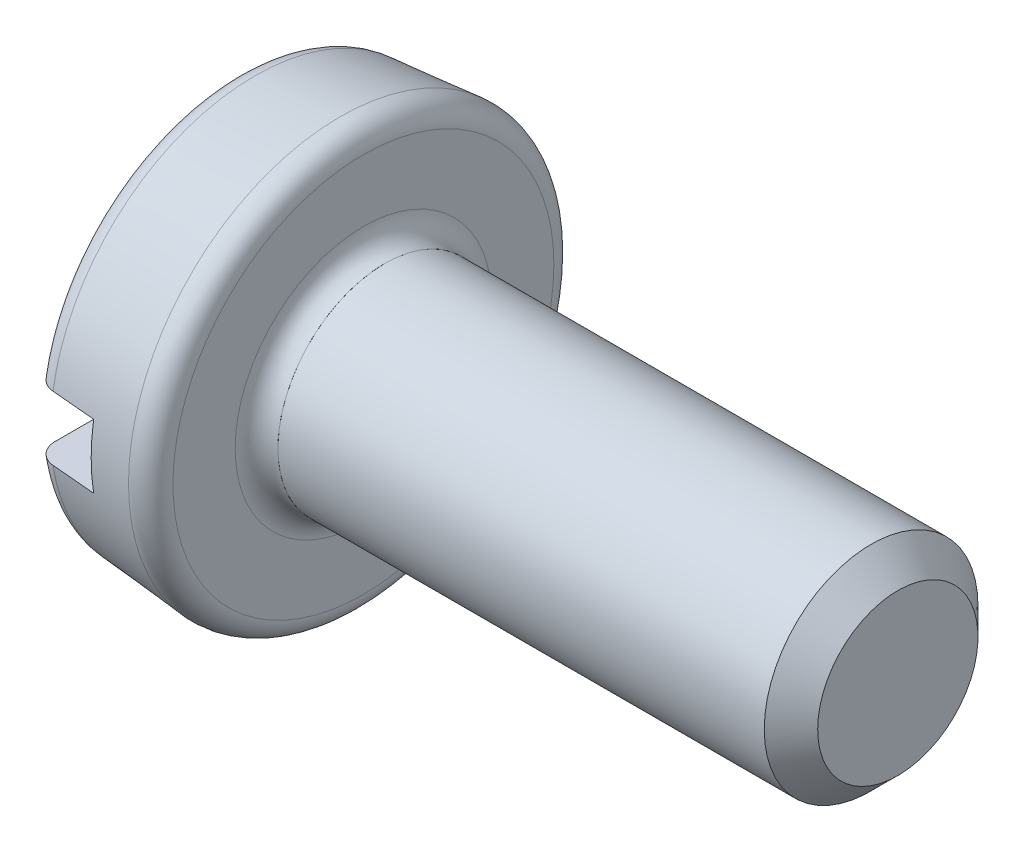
ISO-10303-21;
HEADER;
FILE_DESCRIPTION(('STEP AP214'),'2;1');
FILE_NAME('part.step','',(''),(''),'','','');
FILE_SCHEMA(('AUTOMOTIVE_DESIGN { 1 0 10303 214 1 1 1 1 }'));
ENDSEC;
DATA;
#1=APPLICATION_CONTEXT('core data for automotive mechanical design processes');
#2=APPLICATION_PROTOCOL_DEFINITION('international standard','automotive_design',2000,#1);
#3=PRODUCT_CONTEXT('',#1,'mechanical');
#4=PRODUCT('Part','Part','',(#3));
#5=PRODUCT_RELATED_PRODUCT_CATEGORY('part','',(#4));
#6=PRODUCT_DEFINITION_FORMATION('','',#4);
#7=PRODUCT_DEFINITION_CONTEXT('part definition',#1,'design');
#8=PRODUCT_DEFINITION('design','',#6,#7);
#9=PRODUCT_DEFINITION_SHAPE('','',#8);
#10=(LENGTH_UNIT() NAMED_UNIT(*) SI_UNIT(.MILLI.,.METRE.));
#11=(NAMED_UNIT(*) PLANE_ANGLE_UNIT() SI_UNIT($,.RADIAN.));
#12=(NAMED_UNIT(*) SI_UNIT($,.STERADIAN.) SOLID_ANGLE_UNIT());
#13=UNCERTAINTY_MEASURE_WITH_UNIT(LENGTH_MEASURE(1.E-05),#10,'distance_accuracy_value','');
#14=(GEOMETRIC_REPRESENTATION_CONTEXT(3) GLOBAL_UNCERTAINTY_ASSIGNED_CONTEXT((#13)) GLOBAL_UNIT_ASSIGNED_CONTEXT((#10,
#11,#12)) REPRESENTATION_CONTEXT('',''));
#15=CARTESIAN_POINT('',(0.,0.,0.));
#16=DIRECTION('',(0.,0.,1.));
#17=DIRECTION('',(1.,0.,0.));
#18=AXIS2_PLACEMENT_3D('',#15,#16,#17);
#19=CARTESIAN_POINT('',(-0.6,-0.3,2.378085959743));
#20=DIRECTION('',(1.,0.,0.));
#21=DIRECTION('',(0.,0.,-1.));
#22=AXIS2_PLACEMENT_3D('',#19,#20,#21);
#23=PLANE('',#22);
#24=CARTESIAN_POINT('',(-0.600000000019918,0.,0.));
#25=DIRECTION('',(1.,0.,0.));
#26=DIRECTION('',(0.,0.,-1.));
#27=AXIS2_PLACEMENT_3D('',#24,#25,#26);
#28=CIRCLE('',#27,1.94750680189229);
#29=CARTESIAN_POINT('',(-0.600000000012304,-0.3,-1.92426160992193));
#30=VERTEX_POINT('',#29);
#31=CARTESIAN_POINT('',(-0.600000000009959,0.3,-1.92426160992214));
#32=VERTEX_POINT('',#31);
#33=EDGE_CURVE('P0_E93',#30,#32,#28,.T.);
#34=ORIENTED_EDGE('',*,*,#33,.F.);
#35=DIRECTION('',(0.,0.,-1.));
#36=VECTOR('',#35,1.);
#37=CARTESIAN_POINT('',(-0.6,-0.3,2.378085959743));
#38=LINE('',#37,#36);
#39=CARTESIAN_POINT('',(-0.600000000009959,-0.3,1.92426160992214));
#40=VERTEX_POINT('',#39);
#41=EDGE_CURVE('P0_E100',#30,#40,#38,.F.);
#42=ORIENTED_EDGE('',*,*,#41,.T.);
#43=CARTESIAN_POINT('',(-0.600000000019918,0.,0.));
#44=DIRECTION('',(1.,0.,0.));
#45=DIRECTION('',(0.,0.,-1.));
#46=AXIS2_PLACEMENT_3D('',#43,#44,#45);
#47=CIRCLE('',#46,1.94750680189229);
#48=CARTESIAN_POINT('',(-0.600000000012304,0.3,1.92426160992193));
#49=VERTEX_POINT('',#48);
#50=EDGE_CURVE('P0_E85',#49,#40,#47,.T.);
#51=ORIENTED_EDGE('',*,*,#50,.F.);
#52=DIRECTION('',(0.,0.,1.));
#53=VECTOR('',#52,1.);
#54=CARTESIAN_POINT('',(-0.6,0.3,2.378085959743));
#55=LINE('',#54,#53);
#56=EDGE_CURVE('P0_E92',#49,#32,#55,.F.);
#57=ORIENTED_EDGE('',*,*,#56,.T.);
#58=EDGE_LOOP('',(#34,#42,#51,#57));
#59=FACE_BOUND('',#58,.T.);
#60=ADVANCED_FACE('P0_F16',(#59),#23,.F.);
#61=CARTESIAN_POINT('',(-0.6,0.3,2.378085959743));
#62=DIRECTION('',(0.,1.,0.));
#63=DIRECTION('',(0.,0.,1.));
#64=AXIS2_PLACEMENT_3D('',#61,#62,#63);
#65=PLANE('',#64);
#66=DIRECTION('',(0.,0.,-1.));
#67=VECTOR('',#66,1.);
#68=CARTESIAN_POINT('',(-1.2,0.3,0.));
#69=LINE('',#68,#67);
#70=CARTESIAN_POINT('',(-1.2,0.3,1.685253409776));
#71=VERTEX_POINT('',#70);
#72=CARTESIAN_POINT('',(-1.2,0.3,-1.685253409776));
#73=VERTEX_POINT('',#72);
#74=EDGE_CURVE('P0_E207',#71,#73,#69,.T.);
#75=ORIENTED_EDGE('',*,*,#74,.T.);
#76=CARTESIAN_POINT('',(-1.01743114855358,0.3,-1.88729135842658));
#77=CARTESIAN_POINT('',(-1.02855492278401,0.3,-1.88631602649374));
#78=CARTESIAN_POINT('',(-1.03958952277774,0.3,-1.88437868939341));
#79=CARTESIAN_POINT('',(-1.0611663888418,0.3,-1.87868526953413));
#80=CARTESIAN_POINT('',(-1.07170919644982,0.3,-1.87493124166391));
#81=CARTESIAN_POINT('',(-1.09201834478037,0.3,-1.86570550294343));
#82=CARTESIAN_POINT('',(-1.10178442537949,0.3,-1.86023321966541));
#83=CARTESIAN_POINT('',(-1.12026547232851,0.3,-1.84773796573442));
#84=CARTESIAN_POINT('',(-1.12898056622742,0.3,-1.84071518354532));
#85=CARTESIAN_POINT('',(-1.145176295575,0.3,-1.82527371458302));
#86=CARTESIAN_POINT('',(-1.15264883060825,0.299999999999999,-1.81684653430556));
#87=CARTESIAN_POINT('',(-1.1660944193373,0.3,-1.79887020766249));
#88=CARTESIAN_POINT('',(-1.17206729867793,0.300000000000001,-1.78932093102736));
#89=CARTESIAN_POINT('',(-1.18242806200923,0.300000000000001,-1.76923783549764));
#90=CARTESIAN_POINT('',(-1.18679394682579,0.3,-1.75869266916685));
#91=CARTESIAN_POINT('',(-1.19371148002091,0.3,-1.73703601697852));
#92=CARTESIAN_POINT('',(-1.19626509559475,0.3,-1.72592515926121));
#93=CARTESIAN_POINT('',(-1.19929666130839,0.300000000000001,-1.70493797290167));
#94=CARTESIAN_POINT('',(-1.20000597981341,0.3,-1.69509457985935));
#95=CARTESIAN_POINT('',(-1.2,0.299999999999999,-1.685253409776));
#96=B_SPLINE_CURVE_WITH_KNOTS('',3,(#76,#77,#78,#79,#80,#81,#82,#83,#84,#85,#86,#87,#88,#89,#90,
#91,#92,#93,#94,#95),.UNSPECIFIED.,.F.,.F.,(4,2,2,2,2,2,2,2,2,4),(0.,0.033452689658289,
0.0668676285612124,0.10029371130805,0.133715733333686,0.167347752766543,0.20098368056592,
0.235064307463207,0.269107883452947,0.2986120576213),.UNSPECIFIED.);
#97=CARTESIAN_POINT('',(-1.01743114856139,0.3,-1.88729135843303));
#98=VERTEX_POINT('',#97);
#99=EDGE_CURVE('P0_E108',#98,#73,#96,.T.);
#100=ORIENTED_EDGE('',*,*,#99,.F.);
#101=CARTESIAN_POINT('',(-0.600000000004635,0.3,-1.92426160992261));
#102=CARTESIAN_POINT('',(-0.669571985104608,0.3,-1.91810133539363));
#103=CARTESIAN_POINT('',(-0.739143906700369,0.3,-1.91194034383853));
#104=CARTESIAN_POINT('',(-0.878287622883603,0.3,-1.89961692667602));
#105=CARTESIAN_POINT('',(-0.947859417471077,0.3,-1.89345450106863));
#106=CARTESIAN_POINT('',(-1.01743114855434,0.3,-1.8872913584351));
#107=B_SPLINE_CURVE_WITH_KNOTS('',3,(#101,#102,#103,#104,#105,#106),.UNSPECIFIED.,.F.,.F.,(4,2,
4),(0.,0.209532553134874,0.419065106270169),.UNSPECIFIED.);
#108=EDGE_CURVE('P0_E106',#32,#98,#107,.T.);
#109=ORIENTED_EDGE('',*,*,#108,.F.);
#110=ORIENTED_EDGE('',*,*,#56,.F.);
#111=CARTESIAN_POINT('',(-1.01743114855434,0.3,1.8872913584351));
#112=CARTESIAN_POINT('',(-0.947859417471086,0.3,1.89345450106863));
#113=CARTESIAN_POINT('',(-0.878287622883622,0.3,1.89961692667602));
#114=CARTESIAN_POINT('',(-0.739143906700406,0.3,1.91194034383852));
#115=CARTESIAN_POINT('',(-0.669571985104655,0.3,1.91810133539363));
#116=CARTESIAN_POINT('',(-0.600000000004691,0.3,1.9242616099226));
#117=B_SPLINE_CURVE_WITH_KNOTS('',3,(#111,#112,#113,#114,#115,#116),.UNSPECIFIED.,.F.,.F.,(4,2,
4),(0.,0.209532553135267,0.419065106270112),.UNSPECIFIED.);
#118=CARTESIAN_POINT('',(-1.01743114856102,0.299999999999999,1.88729135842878));
#119=VERTEX_POINT('',#118);
#120=EDGE_CURVE('P0_E80',#119,#49,#117,.T.);
#121=ORIENTED_EDGE('',*,*,#120,.F.);
#122=CARTESIAN_POINT('',(-1.2,0.3,1.685253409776));
#123=CARTESIAN_POINT('',(-1.2000091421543,0.300000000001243,1.69678780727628));
#124=CARTESIAN_POINT('',(-1.19903333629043,0.300000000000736,1.70832090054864));
#125=CARTESIAN_POINT('',(-1.19517364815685,0.299999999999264,1.73106067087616));
#126=CARTESIAN_POINT('',(-1.19229021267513,0.299999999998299,1.74226742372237));
#127=CARTESIAN_POINT('',(-1.18467433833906,0.299999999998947,1.76404410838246));
#128=CARTESIAN_POINT('',(-1.17994059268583,0.300000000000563,1.77461358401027));
#129=CARTESIAN_POINT('',(-1.16875350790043,0.299999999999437,1.7947947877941));
#130=CARTESIAN_POINT('',(-1.16230085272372,0.299999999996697,1.80440689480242));
#131=CARTESIAN_POINT('',(-1.1479094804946,0.299999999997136,1.82231766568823));
#132=CARTESIAN_POINT('',(-1.13998323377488,0.300000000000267,1.83062634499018));
#133=CARTESIAN_POINT('',(-1.12283174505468,0.299999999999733,1.84577236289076));
#134=CARTESIAN_POINT('',(-1.11360664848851,0.299999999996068,1.85260986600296));
#135=CARTESIAN_POINT('',(-1.09424572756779,0.299999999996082,1.86452825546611));
#136=CARTESIAN_POINT('',(-1.08412291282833,0.299999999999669,1.86963028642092));
#137=CARTESIAN_POINT('',(-1.06317023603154,0.30000000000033,1.87803183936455));
#138=CARTESIAN_POINT('',(-1.05234148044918,0.299999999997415,1.88133410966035));
#139=CARTESIAN_POINT('',(-1.03343494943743,0.29999999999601,1.88538028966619));
#140=CARTESIAN_POINT('',(-1.02545352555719,0.299999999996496,1.8865852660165));
#141=CARTESIAN_POINT('',(-1.01743114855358,0.300000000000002,1.88729135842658));
#142=B_SPLINE_CURVE_WITH_KNOTS('',3,(#122,#123,#124,#125,#126,#127,#128,#129,#130,#131,#132,
#133,#134,#135,#136,#137,#138,#139,#140,#141),.UNSPECIFIED.,.F.,.F.,(4,2,2,2,2,2,2,2,2,4),(0.,
0.0345603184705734,0.0691125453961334,0.103689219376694,0.138252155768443,0.17253491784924,
0.206813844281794,0.240658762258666,0.274451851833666,0.298605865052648),.UNSPECIFIED.);
#143=EDGE_CURVE('P0_E336',#71,#119,#142,.T.);
#144=ORIENTED_EDGE('',*,*,#143,.F.);
#145=EDGE_LOOP('',(#75,#100,#109,#110,#121,#144));
#146=FACE_BOUND('',#145,.T.);
#147=ADVANCED_FACE('P0_F104',(#146),#65,.F.);
#148=CARTESIAN_POINT('',(-1.2,-0.3,2.378085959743));
#149=DIRECTION('',(0.,-1.,0.));
#150=DIRECTION('',(0.,0.,-1.));
#151=AXIS2_PLACEMENT_3D('',#148,#149,#150);
#152=PLANE('',#151);
#153=CARTESIAN_POINT('',(-1.01743114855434,-0.3,-1.8872913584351));
#154=CARTESIAN_POINT('',(-0.947859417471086,-0.3,-1.89345450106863));
#155=CARTESIAN_POINT('',(-0.878287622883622,-0.3,-1.89961692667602));
#156=CARTESIAN_POINT('',(-0.739143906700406,-0.3,-1.91194034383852));
#157=CARTESIAN_POINT('',(-0.669571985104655,-0.3,-1.91810133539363));
#158=CARTESIAN_POINT('',(-0.600000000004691,-0.3,-1.9242616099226));
#159=B_SPLINE_CURVE_WITH_KNOTS('',3,(#153,#154,#155,#156,#157,#158),.UNSPECIFIED.,.F.,.F.,(4,2,
4),(0.,0.209532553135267,0.419065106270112),.UNSPECIFIED.);
#160=CARTESIAN_POINT('',(-1.01743114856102,-0.3,-1.88729135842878));
#161=VERTEX_POINT('',#160);
#162=EDGE_CURVE('P0_E117',#161,#30,#159,.T.);
#163=ORIENTED_EDGE('',*,*,#162,.F.);
#164=CARTESIAN_POINT('',(-1.2,-0.3,-1.685253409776));
#165=CARTESIAN_POINT('',(-1.2000091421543,-0.300000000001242,-1.69678780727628));
#166=CARTESIAN_POINT('',(-1.19903333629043,-0.300000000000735,-1.70832090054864));
#167=CARTESIAN_POINT('',(-1.19517364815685,-0.299999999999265,-1.73106067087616));
#168=CARTESIAN_POINT('',(-1.19229021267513,-0.2999999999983,-1.74226742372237));
#169=CARTESIAN_POINT('',(-1.18467433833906,-0.299999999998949,-1.76404410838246));
#170=CARTESIAN_POINT('',(-1.17994059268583,-0.300000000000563,-1.77461358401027));
#171=CARTESIAN_POINT('',(-1.16875350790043,-0.299999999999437,-1.7947947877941));
#172=CARTESIAN_POINT('',(-1.16230085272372,-0.299999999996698,-1.80440689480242));
#173=CARTESIAN_POINT('',(-1.1479094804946,-0.299999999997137,-1.82231766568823));
#174=CARTESIAN_POINT('',(-1.13998323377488,-0.300000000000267,-1.83062634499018));
#175=CARTESIAN_POINT('',(-1.12283174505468,-0.299999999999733,-1.84577236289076));
#176=CARTESIAN_POINT('',(-1.11360664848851,-0.299999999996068,-1.85260986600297));
#177=CARTESIAN_POINT('',(-1.09424572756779,-0.299999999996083,-1.86452825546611));
#178=CARTESIAN_POINT('',(-1.08412291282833,-0.299999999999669,-1.86963028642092));
#179=CARTESIAN_POINT('',(-1.06317023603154,-0.30000000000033,-1.87803183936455));
#180=CARTESIAN_POINT('',(-1.05234148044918,-0.299999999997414,-1.88133410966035));
#181=CARTESIAN_POINT('',(-1.03343494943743,-0.299999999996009,-1.8853802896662));
#182=CARTESIAN_POINT('',(-1.02545352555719,-0.299999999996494,-1.8865852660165));
#183=CARTESIAN_POINT('',(-1.01743114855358,-0.3,-1.88729135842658));
#184=B_SPLINE_CURVE_WITH_KNOTS('',3,(#164,#165,#166,#167,#168,#169,#170,#171,#172,#173,#174,
#175,#176,#177,#178,#179,#180,#181,#182,#183),.UNSPECIFIED.,.F.,.F.,(4,2,2,2,2,2,2,2,2,4),(0.,
0.0345603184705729,0.0691125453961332,0.103689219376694,0.138252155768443,0.17253491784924,
0.206813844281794,0.240658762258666,0.274451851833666,0.298605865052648),.UNSPECIFIED.);
#185=CARTESIAN_POINT('',(-1.2,-0.3,-1.685253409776));
#186=VERTEX_POINT('',#185);
#187=EDGE_CURVE('P0_E124',#186,#161,#184,.T.);
#188=ORIENTED_EDGE('',*,*,#187,.F.);
#189=DIRECTION('',(0.,0.,-1.));
#190=VECTOR('',#189,1.);
#191=CARTESIAN_POINT('',(-1.2,-0.3,0.));
#192=LINE('',#191,#190);
#193=CARTESIAN_POINT('',(-1.2,-0.3,1.685253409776));
#194=VERTEX_POINT('',#193);
#195=EDGE_CURVE('P0_E198',#186,#194,#192,.F.);
#196=ORIENTED_EDGE('',*,*,#195,.T.);
#197=CARTESIAN_POINT('',(-1.01743114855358,-0.299999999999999,1.88729135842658));
#198=CARTESIAN_POINT('',(-1.02855492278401,-0.299999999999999,1.88631602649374));
#199=CARTESIAN_POINT('',(-1.03958952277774,-0.299999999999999,1.88437868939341));
#200=CARTESIAN_POINT('',(-1.0611663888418,-0.300000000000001,1.87868526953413));
#201=CARTESIAN_POINT('',(-1.07170919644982,-0.300000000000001,1.87493124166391));
#202=CARTESIAN_POINT('',(-1.09201834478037,-0.300000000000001,1.86570550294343));
#203=CARTESIAN_POINT('',(-1.10178442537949,-0.3,1.86023321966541));
#204=CARTESIAN_POINT('',(-1.12026547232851,-0.3,1.84773796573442));
#205=CARTESIAN_POINT('',(-1.12898056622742,-0.300000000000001,1.84071518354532));
#206=CARTESIAN_POINT('',(-1.145176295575,-0.300000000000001,1.82527371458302));
#207=CARTESIAN_POINT('',(-1.15264883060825,-0.3,1.81684653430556));
#208=CARTESIAN_POINT('',(-1.1660944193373,-0.3,1.79887020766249));
#209=CARTESIAN_POINT('',(-1.17206729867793,-0.3,1.78932093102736));
#210=CARTESIAN_POINT('',(-1.18242806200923,-0.3,1.76923783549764));
#211=CARTESIAN_POINT('',(-1.18679394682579,-0.3,1.75869266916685));
#212=CARTESIAN_POINT('',(-1.19371148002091,-0.3,1.73703601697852));
#213=CARTESIAN_POINT('',(-1.19626509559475,-0.299999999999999,1.72592515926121));
#214=CARTESIAN_POINT('',(-1.19929666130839,-0.299999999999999,1.70493797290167));
#215=CARTESIAN_POINT('',(-1.20000597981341,-0.299999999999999,1.69509457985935));
#216=CARTESIAN_POINT('',(-1.2,-0.3,1.685253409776));
#217=B_SPLINE_CURVE_WITH_KNOTS('',3,(#197,#198,#199,#200,#201,#202,#203,#204,#205,#206,#207,
#208,#209,#210,#211,#212,#213,#214,#215,#216),.UNSPECIFIED.,.F.,.F.,(4,2,2,2,2,2,2,2,2,4),(0.,
0.0334526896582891,0.0668676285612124,0.10029371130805,0.133715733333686,0.167347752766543,
0.20098368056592,0.235064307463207,0.269107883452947,0.2986120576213),.UNSPECIFIED.);
#218=CARTESIAN_POINT('',(-1.01743114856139,-0.3,1.88729135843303));
#219=VERTEX_POINT('',#218);
#220=EDGE_CURVE('P0_E345',#219,#194,#217,.T.);
#221=ORIENTED_EDGE('',*,*,#220,.F.);
#222=CARTESIAN_POINT('',(-0.600000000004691,-0.3,1.9242616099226));
#223=CARTESIAN_POINT('',(-0.669571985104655,-0.3,1.91810133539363));
#224=CARTESIAN_POINT('',(-0.739143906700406,-0.3,1.91194034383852));
#225=CARTESIAN_POINT('',(-0.878287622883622,-0.3,1.89961692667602));
#226=CARTESIAN_POINT('',(-0.947859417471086,-0.3,1.89345450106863));
#227=CARTESIAN_POINT('',(-1.01743114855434,-0.3,1.8872913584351));
#228=B_SPLINE_CURVE_WITH_KNOTS('',3,(#222,#223,#224,#225,#226,#227),.UNSPECIFIED.,.F.,.F.,(4,2,
4),(0.,0.209532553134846,0.419065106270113),.UNSPECIFIED.);
#229=EDGE_CURVE('P0_E149',#40,#219,#228,.T.);
#230=ORIENTED_EDGE('',*,*,#229,.F.);
#231=ORIENTED_EDGE('',*,*,#41,.F.);
#232=EDGE_LOOP('',(#163,#188,#196,#221,#230,#231));
#233=FACE_BOUND('',#232,.T.);
#234=ADVANCED_FACE('P0_F126',(#233),#152,.F.);
#235=CARTESIAN_POINT('',(-1.2,0.,0.));
#236=DIRECTION('',(1.,0.,0.));
#237=DIRECTION('',(0.,0.,-1.));
#238=AXIS2_PLACEMENT_3D('',#235,#236,#237);
#239=PLANE('',#238);
#240=ORIENTED_EDGE('',*,*,#74,.F.);
#241=CARTESIAN_POINT('',(-1.2,0.,0.));
#242=DIRECTION('',(1.,0.,0.));
#243=DIRECTION('',(0.,0.175259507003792,-0.98452227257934));
#244=AXIS2_PLACEMENT_3D('',#241,#242,#243);
#245=CIRCLE('',#244,1.71174736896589);
#246=EDGE_CURVE('P0_E206',#73,#71,#245,.T.);
#247=ORIENTED_EDGE('',*,*,#246,.F.);
#248=EDGE_LOOP('',(#240,#247));
#249=FACE_BOUND('',#248,.T.);
#250=ADVANCED_FACE('P0_F229',(#249),#239,.F.);
#251=CARTESIAN_POINT('',(-1.2,0.,0.));
#252=DIRECTION('',(1.,0.,0.));
#253=DIRECTION('',(0.,0.,-1.));
#254=AXIS2_PLACEMENT_3D('',#251,#252,#253);
#255=PLANE('',#254);
#256=ORIENTED_EDGE('',*,*,#195,.F.);
#257=CARTESIAN_POINT('',(-1.2,0.,0.));
#258=DIRECTION('',(1.,0.,0.));
#259=DIRECTION('',(0.,-0.175259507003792,0.98452227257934));
#260=AXIS2_PLACEMENT_3D('',#257,#258,#259);
#261=CIRCLE('',#260,1.71174736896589);
#262=EDGE_CURVE('P0_E194',#194,#186,#261,.T.);
#263=ORIENTED_EDGE('',*,*,#262,.F.);
#264=EDGE_LOOP('',(#256,#263));
#265=FACE_BOUND('',#264,.T.);
#266=ADVANCED_FACE('P0_F179',(#265),#255,.F.);
#267=CARTESIAN_POINT('',(-1.,0.,0.));
#268=DIRECTION('',(1.,0.,0.));
#269=DIRECTION('',(0.,-0.999955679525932,-0.0094148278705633));
#270=AXIS2_PLACEMENT_3D('',#267,#268,#269);
#271=TOROIDAL_SURFACE('',#270,1.711747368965,0.2);
#272=ORIENTED_EDGE('',*,*,#99,.T.);
#273=ORIENTED_EDGE('',*,*,#246,.T.);
#274=ORIENTED_EDGE('',*,*,#143,.T.);
#275=CARTESIAN_POINT('',(-1.01743114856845,0.,0.));
#276=DIRECTION('',(1.,0.,0.));
#277=DIRECTION('',(0.,-1.,0.));
#278=AXIS2_PLACEMENT_3D('',#275,#276,#277);
#279=CIRCLE('',#278,1.91098630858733);
#280=EDGE_CURVE('P0_E88',#98,#119,#279,.T.);
#281=ORIENTED_EDGE('',*,*,#280,.F.);
#282=EDGE_LOOP('',(#272,#273,#274,#281));
#283=FACE_BOUND('',#282,.T.);
#284=ADVANCED_FACE('P0_F174',(#283),#271,.T.);
#285=CARTESIAN_POINT('',(-1.,0.,0.));
#286=DIRECTION('',(1.,0.,0.));
#287=DIRECTION('',(0.,-0.999955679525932,-0.0094148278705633));
#288=AXIS2_PLACEMENT_3D('',#285,#286,#287);
#289=TOROIDAL_SURFACE('',#288,1.711747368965,0.2);
#290=CARTESIAN_POINT('',(-1.01743114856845,0.,0.));
#291=DIRECTION('',(1.,0.,0.));
#292=DIRECTION('',(0.,-1.,0.));
#293=AXIS2_PLACEMENT_3D('',#290,#291,#292);
#294=CIRCLE('',#293,1.91098630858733);
#295=EDGE_CURVE('P0_E330',#219,#161,#294,.T.);
#296=ORIENTED_EDGE('',*,*,#295,.F.);
#297=ORIENTED_EDGE('',*,*,#220,.T.);
#298=ORIENTED_EDGE('',*,*,#262,.T.);
#299=ORIENTED_EDGE('',*,*,#187,.T.);
#300=EDGE_LOOP('',(#296,#297,#298,#299));
#301=FACE_BOUND('',#300,.T.);
#302=ADVANCED_FACE('P0_F133',(#301),#289,.T.);
#303=CARTESIAN_POINT('',(-0.217431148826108,0.,0.));
#304=DIRECTION('',(1.,0.,0.));
#305=DIRECTION('',(0.,0.,-1.));
#306=AXIS2_PLACEMENT_3D('',#303,#304,#305);
#307=CONICAL_SURFACE('',#306,1.98097723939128,0.0872664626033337);
#308=CARTESIAN_POINT('',(-0.217431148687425,0.,0.));
#309=DIRECTION('',(1.,0.,0.));
#310=DIRECTION('',(0.,0.999979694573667,0.00637263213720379));
#311=AXIS2_PLACEMENT_3D('',#308,#309,#310);
#312=CIRCLE('',#311,1.98097723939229);
#313=CARTESIAN_POINT('',(-0.217431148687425,1.98093701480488,0.0126240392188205));
#314=VERTEX_POINT('',#313);
#315=EDGE_CURVE('P0_E328',#314,#314,#312,.T.);
#316=ORIENTED_EDGE('',*,*,#315,.F.);
#317=EDGE_LOOP('',(#316));
#318=FACE_BOUND('',#317,.T.);
#319=ORIENTED_EDGE('',*,*,#295,.T.);
#320=ORIENTED_EDGE('',*,*,#162,.T.);
#321=ORIENTED_EDGE('',*,*,#33,.T.);
#322=ORIENTED_EDGE('',*,*,#108,.T.);
#323=ORIENTED_EDGE('',*,*,#280,.T.);
#324=ORIENTED_EDGE('',*,*,#120,.T.);
#325=ORIENTED_EDGE('',*,*,#50,.T.);
#326=ORIENTED_EDGE('',*,*,#229,.T.);
#327=EDGE_LOOP('',(#319,#320,#321,#322,#323,#324,#325,#326));
#328=FACE_BOUND('',#327,.T.);
#329=ADVANCED_FACE('P0_F83',(#318,#328),#307,.T.);
#330=CARTESIAN_POINT('',(-0.2,0.,0.));
#331=DIRECTION('',(1.,0.,0.));
#332=DIRECTION('',(0.,0.999979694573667,0.00637263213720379));
#333=AXIS2_PLACEMENT_3D('',#330,#331,#332);
#334=TOROIDAL_SURFACE('',#333,1.781738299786,0.2);
#335=CARTESIAN_POINT('',(0.,-1.781738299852,0.));
#336=CARTESIAN_POINT('',(-9.65812104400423E-10,-1.78172578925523,0.0213487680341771));
#337=CARTESIAN_POINT('',(-1.22679447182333E-09,-1.78133479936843,0.0426972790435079));
#338=CARTESIAN_POINT('',(-1.06259360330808E-09,-1.7797970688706,0.0853663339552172));
#339=CARTESIAN_POINT('',(-6.37433884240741E-10,-1.77865035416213,0.106686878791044));
#340=CARTESIAN_POINT('',(1.75584069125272E-10,-1.77560240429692,0.149273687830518));
#341=CARTESIAN_POINT('',(5.63442877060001E-10,-1.77370118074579,0.170539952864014));
#342=CARTESIAN_POINT('',(-6.81569083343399E-09,-1.76914696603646,0.212991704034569));
#343=CARTESIAN_POINT('',(-1.45827119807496E-08,-1.76649397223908,0.234177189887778));
#344=CARTESIAN_POINT('',(-4.98510761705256E-08,-1.76043835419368,0.276442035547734));
#345=CARTESIAN_POINT('',(-7.73528612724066E-08,-1.75703571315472,0.297521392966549));
#346=CARTESIAN_POINT('',(-1.38672732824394E-07,-1.75231922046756,0.323785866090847));
#347=CARTESIAN_POINT('',(-1.52284693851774E-07,-1.75135270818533,0.329034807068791));
#348=CARTESIAN_POINT('',(-2.08095446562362E-07,-1.74739699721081,0.349978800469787));
#349=CARTESIAN_POINT('',(-2.53186639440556E-07,-1.74421660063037,0.365638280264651));
#350=CARTESIAN_POINT('',(-3.36796399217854E-07,-1.73628925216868,0.402066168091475));
#351=CARTESIAN_POINT('',(-3.68116257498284E-07,-1.73137345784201,0.422797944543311));
#352=CARTESIAN_POINT('',(-3.83939330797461E-07,-1.72078075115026,0.464064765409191));
#353=CARTESIAN_POINT('',(-3.68445377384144E-07,-1.71510388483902,0.484599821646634));
#354=CARTESIAN_POINT('',(-2.98214960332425E-07,-1.70299276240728,0.525442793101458));
#355=CARTESIAN_POINT('',(-2.43482375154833E-07,-1.69655858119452,0.545750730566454));
#356=CARTESIAN_POINT('',(-1.26343645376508E-07,-1.68295580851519,0.586117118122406));
#357=CARTESIAN_POINT('',(-6.39385544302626E-08,-1.67578731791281,0.606175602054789));
#358=CARTESIAN_POINT('',(-1.19986474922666E-08,-1.66445286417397,0.636039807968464));
#359=CARTESIAN_POINT('',(-1.62952640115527E-09,-1.66057793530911,0.645956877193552));
#360=CARTESIAN_POINT('',(6.42979786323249E-10,-1.65508536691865,0.65975146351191));
#361=CARTESIAN_POINT('',(-7.47428986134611E-11,-1.65352140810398,0.663650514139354));
#362=CARTESIAN_POINT('',(-2.56988709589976E-09,-1.64486126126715,0.685049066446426));
#363=CARTESIAN_POINT('',(7.15970268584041E-10,-1.63753362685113,0.702455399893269));
#364=CARTESIAN_POINT('',(-8.68942379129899E-09,-1.61465127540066,0.754481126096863));
#365=CARTESIAN_POINT('',(-4.08584760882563E-08,-1.59825893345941,0.788738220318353));
#366=CARTESIAN_POINT('',(-1.37866878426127E-07,-1.57025210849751,0.842774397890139));
#367=CARTESIAN_POINT('',(-1.84707584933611E-07,-1.55931851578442,0.862911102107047));
#368=CARTESIAN_POINT('',(-2.75648038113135E-07,-1.53674405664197,0.902616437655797));
#369=CARTESIAN_POINT('',(-3.19763382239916E-07,-1.52510815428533,0.922187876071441));
#370=CARTESIAN_POINT('',(-3.68408762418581E-07,-1.50534865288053,0.953992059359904));
#371=CARTESIAN_POINT('',(-3.81433128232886E-07,-1.49744528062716,0.966362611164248));
#372=CARTESIAN_POINT('',(-4.01031333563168E-07,-1.47354229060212,1.00275870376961));
#373=CARTESIAN_POINT('',(-3.8921054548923E-07,-1.45709896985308,1.0264955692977));
#374=CARTESIAN_POINT('',(-3.44086372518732E-07,-1.42647328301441,1.06846714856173));
#375=CARTESIAN_POINT('',(-3.15552892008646E-07,-1.4124965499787,1.08685273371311));
#376=CARTESIAN_POINT('',(-2.45991664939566E-07,-1.3838296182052,1.12305738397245));
#377=CARTESIAN_POINT('',(-2.04964859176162E-07,-1.36913947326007,1.14087649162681));
#378=CARTESIAN_POINT('',(-1.22738793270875E-07,-1.33907699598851,1.17592700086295));
#379=CARTESIAN_POINT('',(-8.15395495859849E-08,-1.32370472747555,1.1931584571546));
#380=CARTESIAN_POINT('',(-2.25756340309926E-08,-1.29227475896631,1.22698074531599));
#381=CARTESIAN_POINT('',(-4.80835143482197E-09,-1.27621713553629,1.24357164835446));
#382=CARTESIAN_POINT('',(2.69808874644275E-09,-1.25071162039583,1.26902983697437));
#383=CARTESIAN_POINT('',(1.31590421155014E-09,-1.24145575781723,1.27809123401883));
#384=CARTESIAN_POINT('',(-2.60526997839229E-09,-1.21360473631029,1.30478933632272));
#385=CARTESIAN_POINT('',(-4.95273178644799E-09,-1.19473362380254,1.32214060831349));
#386=CARTESIAN_POINT('',(-3.7062289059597E-08,-1.15864412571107,1.35391872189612));
#387=CARTESIAN_POINT('',(-6.3395207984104E-08,-1.14151028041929,1.36844171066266));
#388=CARTESIAN_POINT('',(-1.15987401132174E-07,-1.11623092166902,1.38906181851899));
#389=CARTESIAN_POINT('',(-1.34401122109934E-07,-1.10829769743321,1.3954207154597));
#390=CARTESIAN_POINT('',(-2.00098478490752E-07,-1.08098807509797,1.41692565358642));
#391=CARTESIAN_POINT('',(-2.51273871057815E-07,-1.061346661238,1.4317376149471));
#392=CARTESIAN_POINT('',(-3.37549434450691E-07,-1.02064986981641,1.46110681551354));
#393=CARTESIAN_POINT('',(-3.71913446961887E-07,-0.999569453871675,1.47562935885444));
#394=CARTESIAN_POINT('',(-3.91241346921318E-07,-0.963705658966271,1.49919065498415));
#395=CARTESIAN_POINT('',(-3.88582218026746E-07,-0.949089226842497,1.50848470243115));
#396=CARTESIAN_POINT('',(-3.70944816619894E-07,-0.914672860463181,1.52966370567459));
#397=CARTESIAN_POINT('',(-3.52156623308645E-07,-0.894768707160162,1.54137996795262));
#398=CARTESIAN_POINT('',(-2.97210287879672E-07,-0.854516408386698,1.5640192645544));
#399=CARTESIAN_POINT('',(-2.61053285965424E-07,-0.834168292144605,1.57494235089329));
#400=CARTESIAN_POINT('',(-1.82792292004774E-07,-0.793059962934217,1.59597878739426));
#401=CARTESIAN_POINT('',(-1.40688797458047E-07,-0.772299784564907,1.60609220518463));
#402=CARTESIAN_POINT('',(-6.55230927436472E-08,-0.730399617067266,1.62549484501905));
#403=CARTESIAN_POINT('',(-3.24599645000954E-08,-0.709259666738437,1.63478415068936));
#404=CARTESIAN_POINT('',(-5.3158612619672E-09,-0.6772891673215,1.64808587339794));
#405=CARTESIAN_POINT('',(-9.47604862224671E-12,-0.666589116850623,1.65241432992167));
#406=CARTESIAN_POINT('',(8.76124331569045E-12,-0.645917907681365,1.66054583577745));
#407=CARTESIAN_POINT('',(-4.51045875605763E-09,-0.635952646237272,1.6643638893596));
#408=CARTESIAN_POINT('',(-2.1905125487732E-08,-0.605962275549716,1.67555801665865));
#409=CARTESIAN_POINT('',(-3.86177700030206E-08,-0.585839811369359,1.68267520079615));
#410=CARTESIAN_POINT('',(-5.24301376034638E-08,-0.545361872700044,1.69620402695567));
#411=CARTESIAN_POINT('',(-4.9531813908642E-08,-0.525006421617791,1.70261573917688));
#412=CARTESIAN_POINT('',(-3.33274264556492E-08,-0.484086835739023,1.71473139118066));
#413=CARTESIAN_POINT('',(-2.0021934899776E-08,-0.463522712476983,1.72043536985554));
#414=CARTESIAN_POINT('',(9.63418420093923E-09,-0.422206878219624,1.73111484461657));
#415=CARTESIAN_POINT('',(2.59847801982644E-08,-0.401455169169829,1.73609034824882));
#416=CARTESIAN_POINT('',(-7.68592984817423E-08,-0.365005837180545,1.74420049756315));
#417=CARTESIAN_POINT('',(-1.63194219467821E-07,-0.349341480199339,1.74748441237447));
#418=CARTESIAN_POINT('',(-2.42710233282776E-07,-0.318080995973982,1.75351171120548));
#419=CARTESIAN_POINT('',(-2.3686719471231E-07,-0.302485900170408,1.75626044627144));
#420=CARTESIAN_POINT('',(-2.03111764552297E-07,-0.260538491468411,1.76307227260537));
#421=CARTESIAN_POINT('',(-1.62840421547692E-07,-0.234122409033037,1.76674885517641));
#422=CARTESIAN_POINT('',(-1.1055043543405E-07,-0.194521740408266,1.77134982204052));
#423=CARTESIAN_POINT('',(-9.45305491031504E-08,-0.181387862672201,1.77272674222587));
#424=CARTESIAN_POINT('',(-5.89061330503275E-08,-0.148547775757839,1.77580087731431));
#425=CARTESIAN_POINT('',(-4.14864442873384E-08,-0.128824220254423,1.77731637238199));
#426=CARTESIAN_POINT('',(-1.39279201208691E-08,-0.085806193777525,1.7799034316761));
#427=CARTESIAN_POINT('',(-5.64819794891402E-09,-0.0625038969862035,1.78084714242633));
#428=CARTESIAN_POINT('',(-4.41288987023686E-10,-0.0261307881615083,1.78161241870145));
#429=CARTESIAN_POINT('',(-1.23488277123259E-10,-0.0130655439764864,1.78174491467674));
#430=CARTESIAN_POINT('',(2.01690310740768E-10,0.0213396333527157,1.78172749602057));
#431=CARTESIAN_POINT('',(-1.1496512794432E-10,0.0426800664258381,1.78134560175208));
#432=CARTESIAN_POINT('',(-1.89829226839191E-11,0.0853327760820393,1.77982055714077));
#433=CARTESIAN_POINT('',(3.93637084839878E-10,0.10664505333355,1.77867742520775));
#434=CARTESIAN_POINT('',(-1.92735268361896E-09,0.149215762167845,1.77563690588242));
#435=CARTESIAN_POINT('',(-4.66093617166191E-09,0.170474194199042,1.77373952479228));
#436=CARTESIAN_POINT('',(-1.85067507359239E-08,0.212909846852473,1.76919039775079));
#437=CARTESIAN_POINT('',(-2.96190444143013E-08,0.234087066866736,1.76653864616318));
#438=CARTESIAN_POINT('',(-8.36877559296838E-08,0.281617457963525,1.7597324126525));
#439=CARTESIAN_POINT('',(-1.33910626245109E-07,0.307941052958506,1.75536798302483));
#440=CARTESIAN_POINT('',(-2.41558102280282E-07,0.349857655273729,1.74744359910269));
#441=CARTESIAN_POINT('',(-2.88030765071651E-07,0.365523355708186,1.74426218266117));
#442=CARTESIAN_POINT('',(-3.70154630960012E-07,0.401965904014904,1.73633070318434));
#443=CARTESIAN_POINT('',(-3.97038123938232E-07,0.422706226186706,1.7314112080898));
#444=CARTESIAN_POINT('',(-4.04449365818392E-07,0.463989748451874,1.72081173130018));
#445=CARTESIAN_POINT('',(-3.84980311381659E-07,0.484532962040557,1.71513180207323));
#446=CARTESIAN_POINT('',(-3.07681141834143E-07,0.525392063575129,1.70301429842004));
#447=CARTESIAN_POINT('',(-2.4985511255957E-07,0.545707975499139,1.69657680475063));
#448=CARTESIAN_POINT('',(-1.28415920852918E-07,0.586090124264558,1.68296745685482));
#449=CARTESIAN_POINT('',(-6.48035932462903E-08,0.606156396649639,1.67579570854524));
#450=CARTESIAN_POINT('',(-1.2093871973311E-08,0.636032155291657,1.66445618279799));
#451=CARTESIAN_POINT('',(-1.64160898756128E-09,0.645953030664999,1.66057954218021));
#452=CARTESIAN_POINT('',(6.46755621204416E-10,0.659747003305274,1.6550871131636));
#453=CARTESIAN_POINT('',(-7.40575184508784E-11,0.663641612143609,1.65352494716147));
#454=CARTESIAN_POINT('',(-2.58455402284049E-09,0.685033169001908,1.64486779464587));
#455=CARTESIAN_POINT('',(7.12453463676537E-10,0.702436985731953,1.63754144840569));
#456=CARTESIAN_POINT('',(-8.66683915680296E-09,0.754467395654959,1.61465785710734));
#457=CARTESIAN_POINT('',(-4.08443675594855E-08,0.788731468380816,1.59826243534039));
#458=CARTESIAN_POINT('',(-1.37868078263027E-07,0.842774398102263,1.5702521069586));
#459=CARTESIAN_POINT('',(-1.84707901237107E-07,0.862911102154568,1.55931851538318));
#460=CARTESIAN_POINT('',(-2.75647723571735E-07,0.902616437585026,1.53674405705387));
#461=CARTESIAN_POINT('',(-3.19763313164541E-07,0.922187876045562,1.52510815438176));
#462=CARTESIAN_POINT('',(-3.68408806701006E-07,0.953992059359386,1.50534865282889));
#463=CARTESIAN_POINT('',(-3.81433143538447E-07,0.966362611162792,1.49744528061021));
#464=CARTESIAN_POINT('',(-4.01031303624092E-07,1.00275870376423,1.47354229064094));
#465=CARTESIAN_POINT('',(-3.89210538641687E-07,1.02649556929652,1.45709896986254));
#466=CARTESIAN_POINT('',(-3.44086378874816E-07,1.06846714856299,1.4264732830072));
#467=CARTESIAN_POINT('',(-3.15552894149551E-07,1.08685273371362,1.41249654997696));
#468=CARTESIAN_POINT('',(-2.45991663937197E-07,1.12305738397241,1.38382961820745));
#469=CARTESIAN_POINT('',(-2.049648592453E-07,1.14087649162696,1.36913947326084));
#470=CARTESIAN_POINT('',(-1.22738794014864E-07,1.17592700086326,1.33907699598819));
#471=CARTESIAN_POINT('',(-8.15395499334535E-08,1.19315845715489,1.32370472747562));
#472=CARTESIAN_POINT('',(-2.25756340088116E-08,1.22698074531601,1.29227475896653));
#473=CARTESIAN_POINT('',(-4.80835143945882E-09,1.24357164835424,1.27621713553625));
#474=CARTESIAN_POINT('',(2.69808875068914E-09,1.26902983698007,1.25071162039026));
#475=CARTESIAN_POINT('',(1.31590422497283E-09,1.27809123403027,1.24145575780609));
#476=CARTESIAN_POINT('',(-2.60527000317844E-09,1.30478933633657,1.21360473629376));
#477=CARTESIAN_POINT('',(-4.95273192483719E-09,1.32214060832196,1.19473362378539));
#478=CARTESIAN_POINT('',(-3.70622888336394E-08,1.3539187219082,1.15864412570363));
#479=CARTESIAN_POINT('',(-6.33952073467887E-08,1.36844171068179,1.14151028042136));
#480=CARTESIAN_POINT('',(-1.15987401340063E-07,1.38906181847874,1.11623092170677));
#481=CARTESIAN_POINT('',(-1.34401122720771E-07,1.39542071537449,1.10829769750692));
#482=CARTESIAN_POINT('',(-2.00098476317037E-07,1.41692565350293,1.08098807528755));
#483=CARTESIAN_POINT('',(-2.51273859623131E-07,1.43173761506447,1.06134666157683));
#484=CARTESIAN_POINT('',(-3.37549445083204E-07,1.46110681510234,1.02064986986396));
#485=CARTESIAN_POINT('',(-3.7191349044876E-07,1.47562935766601,0.999569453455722));
#486=CARTESIAN_POINT('',(-3.91241317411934E-07,1.49919065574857,0.963705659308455));
#487=CARTESIAN_POINT('',(-3.88582124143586E-07,1.50848470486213,0.949089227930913));
#488=CARTESIAN_POINT('',(-3.70944943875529E-07,1.52966370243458,0.914672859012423));
#489=CARTESIAN_POINT('',(-3.52157159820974E-07,1.54137995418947,0.894768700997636));
#490=CARTESIAN_POINT('',(-2.9720975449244E-07,1.56401927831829,0.854516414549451));
#491=CARTESIAN_POINT('',(-2.6105127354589E-07,1.57494240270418,0.834168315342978));
#492=CARTESIAN_POINT('',(-1.8279430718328E-07,1.59597873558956,0.793059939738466));
#493=CARTESIAN_POINT('',(-1.40696318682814E-07,1.60609201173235,0.772299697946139));
#494=CARTESIAN_POINT('',(-6.55155739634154E-08,1.6254950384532,0.730399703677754));
#495=CARTESIAN_POINT('',(-3.24319023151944E-08,1.63478487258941,0.709259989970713));
#496=CARTESIAN_POINT('',(-5.32989200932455E-09,1.64808551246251,0.677289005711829));
#497=CARTESIAN_POINT('',(-4.96878892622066E-11,1.6524132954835,0.666588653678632));
#498=CARTESIAN_POINT('',(1.413559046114E-11,1.6578417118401,0.652792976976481));
#499=CARTESIAN_POINT('',(-3.95053392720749E-10,1.65903576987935,0.64973428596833));
#500=CARTESIAN_POINT('',(-2.32133347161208E-09,1.66340838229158,0.638450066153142));
#501=CARTESIAN_POINT('',(-4.54328704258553E-09,1.66653931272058,0.630206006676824));
#502=CARTESIAN_POINT('',(-9.55390146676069E-09,1.67372639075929,0.610859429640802));
#503=CARTESIAN_POINT('',(-1.22780178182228E-08,1.67773470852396,0.599739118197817));
#504=CARTESIAN_POINT('',(-1.7634385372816E-08,1.68652254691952,0.574588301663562));
#505=CARTESIAN_POINT('',(-2.0067644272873E-08,1.69123943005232,0.560535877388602));
#506=CARTESIAN_POINT('',(-2.4235652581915E-08,1.70124333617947,0.529461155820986));
#507=CARTESIAN_POINT('',(-2.57291633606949E-08,1.70645238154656,0.512413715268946));
#508=CARTESIAN_POINT('',(-2.76618456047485E-08,1.71719307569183,0.475287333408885));
#509=CARTESIAN_POINT('',(-2.78811123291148E-08,1.72263132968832,0.455181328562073));
#510=CARTESIAN_POINT('',(-2.7156524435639E-08,1.7335345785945,0.411880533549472));
#511=CARTESIAN_POINT('',(-2.60404785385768E-08,1.7388904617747,0.388658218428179));
#512=CARTESIAN_POINT('',(-2.28155252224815E-08,1.74928427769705,0.339079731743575));
#513=CARTESIAN_POINT('',(-2.05992572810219E-08,1.75419716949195,0.312697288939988));
#514=CARTESIAN_POINT('',(-1.56270781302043E-08,1.76331087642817,0.256774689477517));
#515=CARTESIAN_POINT('',(-1.28385331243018E-08,1.76737053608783,0.227211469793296));
#516=CARTESIAN_POINT('',(-7.46055722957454E-09,1.77433634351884,0.164934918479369));
#517=CARTESIAN_POINT('',(-4.91939319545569E-09,1.77708532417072,0.132203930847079));
#518=CARTESIAN_POINT('',(-1.44032426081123E-09,1.78057477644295,0.0700936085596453));
#519=CARTESIAN_POINT('',(-3.61700470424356E-10,1.78149635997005,0.0407245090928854));
#520=CARTESIAN_POINT('',(-3.48347331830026E-11,1.78172257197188,0.007569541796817));
#521=CARTESIAN_POINT('',(-1.06250123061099E-11,1.7817364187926,0.00378473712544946));
#522=CARTESIAN_POINT('',(0.,1.781738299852,0.));
#523=B_SPLINE_CURVE_WITH_KNOTS('',3,(#335,#336,#337,#338,#339,#340,#341,#342,#343,#344,#345,
#346,#347,#348,#349,#350,#351,#352,#353,#354,#355,#356,#357,#358,#359,#360,#361,#362,#363,#364,
#365,#366,#367,#368,#369,#370,#371,#372,#373,#374,#375,#376,#377,#378,#379,#380,#381,#382,#383,
#384,#385,#386,#387,#388,#389,#390,#391,#392,#393,#394,#395,#396,#397,#398,#399,#400,#401,#402,
#403,#404,#405,#406,#407,#408,#409,#410,#411,#412,#413,#414,#415,#416,#417,#418,#419,#420,#421,
#422,#423,#424,#425,#426,#427,#428,#429,#430,#431,#432,#433,#434,#435,#436,#437,#438,#439,#440,
#441,#442,#443,#444,#445,#446,#447,#448,#449,#450,#451,#452,#453,#454,#455,#456,#457,#458,#459,
#460,#461,#462,#463,#464,#465,#466,#467,#468,#469,#470,#471,#472,#473,#474,#475,#476,#477,#478,
#479,#480,#481,#482,#483,#484,#485,#486,#487,#488,#489,#490,#491,#492,#493,#494,#495,#496,#497,
#498,#499,#500,#501,#502,#503,#504,#505,#506,#507,#508,#509,#510,#511,#512,#513,#514,#515,#516,
#517,#518,#519,#520,#521,#522),.UNSPECIFIED.,.F.,.F.,(4,2,2,2,2,2,2,2,2,2,2,2,2,2,2,2,2,2,2,2,2,
2,2,2,2,2,2,2,2,2,2,2,2,2,2,2,2,2,2,2,2,2,2,2,2,2,2,2,2,2,2,2,2,2,2,2,2,2,2,2,2,2,2,2,2,2,2,2,2,
2,2,2,2,2,2,2,2,2,2,2,2,2,2,2,2,2,2,2,2,2,2,2,2,4),(0.,0.0640429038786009,0.128083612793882,
0.192123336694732,0.256163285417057,0.320204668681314,0.336216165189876,0.384147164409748,
0.448052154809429,0.511953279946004,0.575848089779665,0.639734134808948,0.671674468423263,
0.684277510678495,0.740927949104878,0.854767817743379,0.923494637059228,0.991782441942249,
1.03581830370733,1.12240625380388,1.19167478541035,1.26093810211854,1.33019495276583,
1.39944408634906,1.43830154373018,1.51518283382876,1.58254823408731,1.61304884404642,
1.6868265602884,1.76359654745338,1.81555315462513,1.88482369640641,1.95408969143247,
2.0233498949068,2.09260306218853,2.12722829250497,2.15924183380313,2.22325993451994,
2.28727165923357,2.35127986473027,2.4152874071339,2.46329540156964,2.5107954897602,
2.59077623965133,2.6303913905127,2.68972526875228,2.75966979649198,2.79886532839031,
2.86288243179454,2.92689798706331,2.99091300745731,3.05492850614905,3.13494773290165,
3.1828992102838,3.24683098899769,3.31075835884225,3.37467892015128,3.43859027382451,
3.470543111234,3.48313178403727,3.53977376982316,3.65363644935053,3.72236326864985,
3.79065107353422,3.83468693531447,3.92127488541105,3.99054341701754,4.05980673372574,
4.12906358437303,4.19831271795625,4.23717017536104,4.31405146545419,4.38141686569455,
4.41191747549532,4.48569519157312,4.5624651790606,4.61442178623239,4.68369232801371,
4.7529583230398,4.82221852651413,4.89147169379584,4.92609692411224,4.93594739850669,
4.96240220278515,4.99786191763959,5.04232622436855,5.09579486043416,5.15826762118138,
5.22974436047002,5.31022499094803,5.39970948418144,5.49819787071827,5.58630875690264,
5.59766316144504),.UNSPECIFIED.);
#524=CARTESIAN_POINT('',(0.,1.7817382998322,0.));
#525=VERTEX_POINT('',#524);
#526=CARTESIAN_POINT('',(0.,-1.7817382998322,0.));
#527=VERTEX_POINT('',#526);
#528=EDGE_CURVE('P0_E268',#525,#527,#523,.F.);
#529=ORIENTED_EDGE('',*,*,#528,.F.);
#530=CARTESIAN_POINT('',(0.,0.,0.));
#531=DIRECTION('',(-1.,0.,0.));
#532=DIRECTION('',(0.,1.,0.));
#533=AXIS2_PLACEMENT_3D('',#530,#531,#532);
#534=CIRCLE('',#533,1.781738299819);
#535=EDGE_CURVE('P0_E319',#527,#525,#534,.F.);
#536=ORIENTED_EDGE('',*,*,#535,.F.);
#537=EDGE_LOOP('',(#529,#536));
#538=FACE_BOUND('',#537,.T.);
#539=ORIENTED_EDGE('',*,*,#315,.T.);
#540=EDGE_LOOP('',(#539));
#541=FACE_BOUND('',#540,.T.);
#542=ADVANCED_FACE('P0_F132',(#538,#541),#334,.T.);
#543=CARTESIAN_POINT('',(5.,0.,0.));
#544=DIRECTION('',(1.,0.,0.));
#545=DIRECTION('',(0.,0.,-1.));
#546=AXIS2_PLACEMENT_3D('',#543,#544,#545);
#547=PLANE('',#546);
#548=CARTESIAN_POINT('',(5.0000000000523,0.,0.));
#549=DIRECTION('',(-1.,0.,0.));
#550=DIRECTION('',(0.,0.,1.));
#551=AXIS2_PLACEMENT_3D('',#548,#549,#550);
#552=CIRCLE('',#551,0.750000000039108);
#553=CARTESIAN_POINT('',(5.0000000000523,0.,0.750000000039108));
#554=VERTEX_POINT('',#553);
#555=EDGE_CURVE('P0_E113',#554,#554,#552,.T.);
#556=ORIENTED_EDGE('',*,*,#555,.F.);
#557=EDGE_LOOP('',(#556));
#558=FACE_BOUND('',#557,.T.);
#559=ADVANCED_FACE('P0_F281',(#558),#547,.T.);
#560=CARTESIAN_POINT('',(0.,0.,0.));
#561=DIRECTION('',(1.,0.,0.));
#562=DIRECTION('',(0.,0.,-1.));
#563=AXIS2_PLACEMENT_3D('',#560,#561,#562);
#564=PLANE('',#563);
#565=CARTESIAN_POINT('',(0.,0.,0.));
#566=DIRECTION('',(1.,0.,0.));
#567=DIRECTION('',(0.,1.,0.));
#568=AXIS2_PLACEMENT_3D('',#565,#566,#567);
#569=CIRCLE('',#568,1.199999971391);
#570=CARTESIAN_POINT('',(0.,-1.1999999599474,0.));
#571=VERTEX_POINT('',#570);
#572=CARTESIAN_POINT('',(0.,1.1999999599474,0.));
#573=VERTEX_POINT('',#572);
#574=EDGE_CURVE('P0_E116',#571,#573,#569,.F.);
#575=ORIENTED_EDGE('',*,*,#574,.T.);
#576=CARTESIAN_POINT('',(0.,-1.199999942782,0.));
#577=CARTESIAN_POINT('',(6.20554192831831E-10,-1.19998737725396,-0.014386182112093));
#578=CARTESIAN_POINT('',(1.22647923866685E-09,-1.19972031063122,-0.0287721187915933));
#579=CARTESIAN_POINT('',(1.8576083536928E-09,-1.19867797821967,-0.0575251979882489));
#580=CARTESIAN_POINT('',(1.88282743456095E-09,-1.19790272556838,-0.0718923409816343));
#581=CARTESIAN_POINT('',(8.01156530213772E-10,-1.19584482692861,-0.100590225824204));
#582=CARTESIAN_POINT('',(-3.05729563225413E-10,-1.19456218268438,-0.114920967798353));
#583=CARTESIAN_POINT('',(4.27937926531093E-10,-1.19149134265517,-0.143528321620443));
#584=CARTESIAN_POINT('',(2.26854743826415E-09,-1.18970313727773,-0.157804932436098));
#585=CARTESIAN_POINT('',(1.54341011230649E-08,-1.18562251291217,-0.186287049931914));
#586=CARTESIAN_POINT('',(2.67594378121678E-08,-1.18333007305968,-0.200492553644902));
#587=CARTESIAN_POINT('',(5.50038855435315E-08,-1.18015312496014,-0.218192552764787));
#588=CARTESIAN_POINT('',(6.13576448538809E-08,-1.17950212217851,-0.22172993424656));
#589=CARTESIAN_POINT('',(8.77419977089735E-08,-1.17684015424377,-0.235831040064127));
#590=CARTESIAN_POINT('',(1.09831329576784E-07,-1.17470054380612,-0.246370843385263));
#591=CARTESIAN_POINT('',(1.51830774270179E-07,-1.16936668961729,-0.270889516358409));
#592=CARTESIAN_POINT('',(1.68560347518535E-07,-1.1660586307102,-0.284843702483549));
#593=CARTESIAN_POINT('',(1.79399245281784E-07,-1.15892950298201,-0.312620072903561));
#594=CARTESIAN_POINT('',(1.73509036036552E-07,-1.15510844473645,-0.326442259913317));
#595=CARTESIAN_POINT('',(1.42071949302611E-07,-1.14695585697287,-0.353934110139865));
#596=CARTESIAN_POINT('',(1.16526273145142E-07,-1.14262435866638,-0.367603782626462));
#597=CARTESIAN_POINT('',(6.09556639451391E-08,-1.13346591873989,-0.394775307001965));
#598=CARTESIAN_POINT('',(3.09311863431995E-08,-1.12863902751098,-0.408277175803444));
#599=CARTESIAN_POINT('',(5.812377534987E-09,-1.12100752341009,-0.428379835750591));
#600=CARTESIAN_POINT('',(7.58948457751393E-10,-1.11839857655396,-0.435055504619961));
#601=CARTESIAN_POINT('',(-3.13449718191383E-10,-1.11465030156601,-0.444463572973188));
#602=CARTESIAN_POINT('',(1.05671821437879E-10,-1.11354723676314,-0.4472105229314));
#603=CARTESIAN_POINT('',(1.49119723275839E-09,-1.10762719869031,-0.461817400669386));
#604=CARTESIAN_POINT('',(-3.54928809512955E-10,-1.10265427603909,-0.47361448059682));
#605=CARTESIAN_POINT('',(2.50627901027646E-09,-1.08726717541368,-0.508545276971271));
#606=CARTESIAN_POINT('',(1.54247421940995E-08,-1.07630322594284,-0.531440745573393));
#607=CARTESIAN_POINT('',(5.78290511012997E-08,-1.05744207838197,-0.567828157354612));
#608=CARTESIAN_POINT('',(7.90376132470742E-08,-1.04998607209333,-0.581551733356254));
#609=CARTESIAN_POINT('',(1.21032631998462E-07,-1.03468355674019,-0.608436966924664));
#610=CARTESIAN_POINT('',(1.41819455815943E-07,-1.02684715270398,-0.621604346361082));
#611=CARTESIAN_POINT('',(1.65709688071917E-07,-1.01362440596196,-0.64286721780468));
#612=CARTESIAN_POINT('',(1.72499441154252E-07,-1.00838939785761,-0.651057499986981));
#613=CARTESIAN_POINT('',(1.84142964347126E-07,-0.992386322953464,-0.675424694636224));
#614=CARTESIAN_POINT('',(1.80284062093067E-07,-0.981316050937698,-0.691405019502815));
#615=CARTESIAN_POINT('',(1.61288727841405E-07,-0.960697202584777,-0.719661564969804));
#616=CARTESIAN_POINT('',(1.48562168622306E-07,-0.951287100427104,-0.732039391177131));
#617=CARTESIAN_POINT('',(1.16691558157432E-07,-0.931986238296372,-0.756413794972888));
#618=CARTESIAN_POINT('',(9.75478531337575E-08,-0.92209550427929,-0.768410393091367));
#619=CARTESIAN_POINT('',(5.87666536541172E-08,-0.901854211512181,-0.792007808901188));
#620=CARTESIAN_POINT('',(3.91291953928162E-08,-0.891503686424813,-0.803608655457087));
#621=CARTESIAN_POINT('',(1.08897166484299E-08,-0.870341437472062,-0.826379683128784));
#622=CARTESIAN_POINT('',(2.28667837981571E-09,-0.859529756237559,-0.837549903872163));
#623=CARTESIAN_POINT('',(-1.32632698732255E-09,-0.84214681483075,-0.854895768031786));
#624=CARTESIAN_POINT('',(-5.27622980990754E-10,-0.835701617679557,-0.861198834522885));
#625=CARTESIAN_POINT('',(1.09392000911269E-09,-0.816759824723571,-0.879326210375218));
#626=CARTESIAN_POINT('',(1.27968277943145E-09,-0.804084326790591,-0.89096512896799));
#627=CARTESIAN_POINT('',(1.40891554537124E-08,-0.779967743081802,-0.912175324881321));
#628=CARTESIAN_POINT('',(2.5052632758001E-08,-0.76858716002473,-0.921815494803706));
#629=CARTESIAN_POINT('',(4.77773542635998E-08,-0.751644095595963,-0.935634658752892));
#630=CARTESIAN_POINT('',(5.59895572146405E-08,-0.746218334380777,-0.939982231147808));
#631=CARTESIAN_POINT('',(8.5469273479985E-08,-0.727651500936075,-0.9545939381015));
#632=CARTESIAN_POINT('',(1.08935721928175E-07,-0.714330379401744,-0.964630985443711));
#633=CARTESIAN_POINT('',(1.4954080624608E-07,-0.686989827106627,-0.984339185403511));
#634=CARTESIAN_POINT('',(1.66535139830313E-07,-0.672961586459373,-0.993998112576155));
#635=CARTESIAN_POINT('',(1.77907183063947E-07,-0.648985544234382,-1.0097495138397));
#636=CARTESIAN_POINT('',(1.7772534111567E-07,-0.639145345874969,-1.01600648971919));
#637=CARTESIAN_POINT('',(1.71612012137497E-07,-0.615974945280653,-1.03026473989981));
#638=CARTESIAN_POINT('',(1.63784566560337E-07,-0.602574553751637,-1.03815239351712));
#639=CARTESIAN_POINT('',(1.39466351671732E-07,-0.575474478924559,-1.05339366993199));
#640=CARTESIAN_POINT('',(1.22975961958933E-07,-0.561774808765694,-1.06074731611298));
#641=CARTESIAN_POINT('',(8.66994486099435E-08,-0.534097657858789,-1.07490939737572));
#642=CARTESIAN_POINT('',(6.69135320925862E-08,-0.520120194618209,-1.08171786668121));
#643=CARTESIAN_POINT('',(3.13367790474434E-08,-0.491909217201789,-1.09477983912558));
#644=CARTESIAN_POINT('',(1.5545615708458E-08,-0.477675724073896,-1.10103338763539));
#645=CARTESIAN_POINT('',(2.54955581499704E-09,-0.456149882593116,-1.10998785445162));
#646=CARTESIAN_POINT('',(-7.18059043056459E-13,-0.448945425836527,-1.11290166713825));
#647=CARTESIAN_POINT('',(6.80047731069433E-13,-0.435023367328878,-1.11837716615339));
#648=CARTESIAN_POINT('',(2.18460762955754E-09,-0.428309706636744,-1.12094888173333));
#649=CARTESIAN_POINT('',(1.06134401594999E-08,-0.4081046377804,-1.12848910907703));
#650=CARTESIAN_POINT('',(1.87354618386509E-08,-0.394547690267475,-1.13328330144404));
#651=CARTESIAN_POINT('',(2.56535592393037E-08,-0.367276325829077,-1.14239674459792));
#652=CARTESIAN_POINT('',(2.44501700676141E-08,-0.353561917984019,-1.1467160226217));
#653=CARTESIAN_POINT('',(1.67230532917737E-08,-0.325991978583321,-1.15487807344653));
#654=CARTESIAN_POINT('',(1.0199387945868E-08,-0.312136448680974,-1.15872085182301));
#655=CARTESIAN_POINT('',(-4.32947211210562E-09,-0.284298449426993,-1.16591599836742));
#656=CARTESIAN_POINT('',(-1.23347171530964E-08,-0.270315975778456,-1.16926834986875));
#657=CARTESIAN_POINT('',(3.4006684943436E-08,-0.245756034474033,-1.17473265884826));
#658=CARTESIAN_POINT('',(7.32695522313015E-08,-0.235200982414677,-1.17694522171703));
#659=CARTESIAN_POINT('',(1.11251037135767E-07,-0.214037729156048,-1.18102613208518));
#660=CARTESIAN_POINT('',(1.10018420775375E-07,-0.203429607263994,-1.18289489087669));
#661=CARTESIAN_POINT('',(9.68377077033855E-08,-0.17512979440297,-1.18748288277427));
#662=CARTESIAN_POINT('',(7.83383697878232E-08,-0.157396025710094,-1.18994655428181));
#663=CARTESIAN_POINT('',(5.42681114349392E-08,-0.130837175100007,-1.193027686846));
#664=CARTESIAN_POINT('',(4.68926952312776E-08,-0.122046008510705,-1.19394845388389));
#665=CARTESIAN_POINT('',(2.96459422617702E-08,-0.099243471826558,-1.19608210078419));
#666=CARTESIAN_POINT('',(2.0875963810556E-08,-0.0852178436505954,-1.19714596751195));
#667=CARTESIAN_POINT('',(7.16030497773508E-09,-0.0552847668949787,-1.19888857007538));
#668=CARTESIAN_POINT('',(2.87195324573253E-09,-0.0393732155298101,-1.19949796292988));
#669=CARTESIAN_POINT('',(3.0683357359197E-10,-0.0156387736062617,-1.19993670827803));
#670=CARTESIAN_POINT('',(8.1537453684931E-11,-0.0078194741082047,-1.20000518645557));
#671=CARTESIAN_POINT('',(-1.49895178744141E-10,0.0143772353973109,-1.19999030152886));
#672=CARTESIAN_POINT('',(1.86221789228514E-10,0.0287550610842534,-1.19973143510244));
#673=CARTESIAN_POINT('',(1.84182127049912E-10,0.0574918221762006,-1.19870114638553));
#674=CARTESIAN_POINT('',(-1.53965632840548E-10,0.0718507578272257,-1.19792973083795));
#675=CARTESIAN_POINT('',(2.32754210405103E-10,0.100532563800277,-1.19587938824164));
#676=CARTESIAN_POINT('',(9.57626798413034E-10,0.114855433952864,-1.19460045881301));
#677=CARTESIAN_POINT('',(6.13854351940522E-09,0.143446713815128,-1.19153484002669));
#678=CARTESIAN_POINT('',(1.0594671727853E-08,0.157715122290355,-1.1897481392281));
#679=CARTESIAN_POINT('',(3.48878397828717E-08,0.189739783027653,-1.18516303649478));
#680=CARTESIAN_POINT('',(5.82918894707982E-08,0.207476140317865,-1.18222337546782));
#681=CARTESIAN_POINT('',(1.10521853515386E-07,0.235709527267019,-1.17688740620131));
#682=CARTESIAN_POINT('',(1.33403500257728E-07,0.24625556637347,-1.1747464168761));
#683=CARTESIAN_POINT('',(1.74384169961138E-07,0.270788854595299,-1.16940809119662));
#684=CARTESIAN_POINT('',(1.88347089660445E-07,0.284751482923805,-1.16609651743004));
#685=CARTESIAN_POINT('',(1.93664283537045E-07,0.312544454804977,-1.15896077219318));
#686=CARTESIAN_POINT('',(1.85019221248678E-07,0.326374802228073,-1.15513661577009));
#687=CARTESIAN_POINT('',(1.48687636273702E-07,0.353882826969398,-1.14697761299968));
#688=CARTESIAN_POINT('',(1.21002421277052E-07,0.367560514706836,-1.1426428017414));
#689=CARTESIAN_POINT('',(6.24334073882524E-08,0.394747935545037,-1.13347774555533));
#690=CARTESIAN_POINT('',(3.15499542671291E-08,0.408257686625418,-1.12864755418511));
#691=CARTESIAN_POINT('',(5.88123119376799E-09,0.428372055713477,-1.12101090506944));
#692=CARTESIAN_POINT('',(7.67569140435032E-10,0.435051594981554,-1.11840021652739));
#693=CARTESIAN_POINT('',(-3.16252835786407E-10,0.444458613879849,-1.11465224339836));
#694=CARTESIAN_POINT('',(1.05331611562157E-10,0.447200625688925,-1.11355117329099));
#695=CARTESIAN_POINT('',(1.50309316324E-09,0.461799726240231,-1.10763446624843));
#696=CARTESIAN_POINT('',(-3.51335723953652E-10,0.473594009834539,-1.10266298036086));
#697=CARTESIAN_POINT('',(2.49037468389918E-09,0.508530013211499,-1.0872744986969));
#698=CARTESIAN_POINT('',(1.54144821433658E-08,0.531433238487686,-1.07630712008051));
#699=CARTESIAN_POINT('',(5.78299815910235E-08,0.567828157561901,-1.05744207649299));
#700=CARTESIAN_POINT('',(7.90378569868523E-08,0.581551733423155,-1.04998607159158));
#701=CARTESIAN_POINT('',(1.21032392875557E-07,0.608436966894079,-1.03468355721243));
#702=CARTESIAN_POINT('',(1.41819403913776E-07,0.621604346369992,-1.02684715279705));
#703=CARTESIAN_POINT('',(1.65709721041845E-07,0.642867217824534,-1.01362440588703));
#704=CARTESIAN_POINT('',(1.7249945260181E-07,0.651057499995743,-1.00838939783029));
#705=CARTESIAN_POINT('',(1.84142941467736E-07,0.675424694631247,-0.992386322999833));
#706=CARTESIAN_POINT('',(1.80284056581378E-07,0.691405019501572,-0.981316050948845));
#707=CARTESIAN_POINT('',(1.61288732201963E-07,0.71966156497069,-0.960697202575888));
#708=CARTESIAN_POINT('',(1.48562169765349E-07,0.732039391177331,-0.951287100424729));
#709=CARTESIAN_POINT('',(1.16691556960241E-07,0.756413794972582,-0.931986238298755));
#710=CARTESIAN_POINT('',(9.75478528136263E-08,0.76841039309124,-0.922095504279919));
#711=CARTESIAN_POINT('',(5.87666539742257E-08,0.792007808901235,-0.901854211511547));
#712=CARTESIAN_POINT('',(3.91291954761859E-08,0.803608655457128,-0.89150368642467));
#713=CARTESIAN_POINT('',(1.08897165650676E-08,0.826379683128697,-0.870341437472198));
#714=CARTESIAN_POINT('',(2.28667836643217E-09,0.837549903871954,-0.859529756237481));
#715=CARTESIAN_POINT('',(-1.32632697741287E-09,0.8548957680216,-0.842146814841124));
#716=CARTESIAN_POINT('',(-5.27622987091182E-10,0.861198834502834,-0.83570161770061));
#717=CARTESIAN_POINT('',(1.09392002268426E-09,0.879326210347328,-0.816759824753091));
#718=CARTESIAN_POINT('',(1.27968288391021E-09,0.890965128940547,-0.804084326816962));
#719=CARTESIAN_POINT('',(1.40891554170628E-08,0.912175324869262,-0.779967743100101));
#720=CARTESIAN_POINT('',(2.50526325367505E-08,0.921815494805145,-0.768587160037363));
#721=CARTESIAN_POINT('',(4.77773543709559E-08,0.935634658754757,-0.751644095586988));
#722=CARTESIAN_POINT('',(5.59895575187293E-08,0.939982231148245,-0.746218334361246));
#723=CARTESIAN_POINT('',(8.54692726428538E-08,0.954593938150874,-0.727651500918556));
#724=CARTESIAN_POINT('',(1.08935717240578E-07,0.96463098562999,-0.714330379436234));
#725=CARTESIAN_POINT('',(1.49540810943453E-07,0.984339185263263,-0.686989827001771));
#726=CARTESIAN_POINT('',(1.66535158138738E-07,0.99399811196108,-0.672961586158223));
#727=CARTESIAN_POINT('',(1.77907170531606E-07,1.00974951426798,-0.648985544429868));
#728=CARTESIAN_POINT('',(1.77725301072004E-07,1.01600649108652,-0.63914534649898));
#729=CARTESIAN_POINT('',(1.71612065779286E-07,1.0302647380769,-0.615974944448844));
#730=CARTESIAN_POINT('',(1.6378479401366E-07,1.03815238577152,-0.602574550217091));
#731=CARTESIAN_POINT('',(1.39466124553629E-07,1.05339367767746,-0.575474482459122));
#732=CARTESIAN_POINT('',(1.22975106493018E-07,1.06074734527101,-0.561774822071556));
#733=CARTESIAN_POINT('',(8.67003043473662E-08,1.07490936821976,-0.534097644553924));
#734=CARTESIAN_POINT('',(6.69167271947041E-08,1.08171775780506,-0.520120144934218));
#735=CARTESIAN_POINT('',(3.1333584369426E-08,1.09477994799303,-0.49190926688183));
#736=CARTESIAN_POINT('',(1.55336927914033E-08,1.10103379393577,-0.477675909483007));
#737=CARTESIAN_POINT('',(2.55551716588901E-09,1.10998765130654,-0.456149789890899));
#738=CARTESIAN_POINT('',(1.6367154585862E-11,1.1129010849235,-0.448945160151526));
#739=CARTESIAN_POINT('',(-5.01793411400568E-12,1.11661994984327,-0.439491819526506));
#740=CARTESIAN_POINT('',(2.28097458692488E-10,1.11748751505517,-0.437267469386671));
#741=CARTESIAN_POINT('',(1.32830161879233E-09,1.12060951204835,-0.429198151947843));
#742=CARTESIAN_POINT('',(2.61016455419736E-09,1.12282828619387,-0.423339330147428));
#743=CARTESIAN_POINT('',(5.49405165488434E-09,1.12786502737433,-0.409725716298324));
#744=CARTESIAN_POINT('',(7.06874385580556E-09,1.13064995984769,-0.401958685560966));
#745=CARTESIAN_POINT('',(1.01563174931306E-08,1.13671271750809,-0.384493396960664));
#746=CARTESIAN_POINT('',(1.15630876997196E-08,1.13994783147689,-0.374780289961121));
#747=CARTESIAN_POINT('',(1.39687253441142E-08,1.14677391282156,-0.353382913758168));
#748=CARTESIAN_POINT('',(1.48355154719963E-08,1.15031215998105,-0.341681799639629));
#749=CARTESIAN_POINT('',(1.5957925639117E-08,1.15757711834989,-0.316267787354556));
#750=CARTESIAN_POINT('',(1.60913641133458E-08,1.16124104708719,-0.302536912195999));
#751=CARTESIAN_POINT('',(1.56857679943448E-08,1.16855844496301,-0.273026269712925));
#752=CARTESIAN_POINT('',(1.50501386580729E-08,1.17213888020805,-0.25722836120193));
#753=CARTESIAN_POINT('',(1.32039348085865E-08,1.17905858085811,-0.223555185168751));
#754=CARTESIAN_POINT('',(1.19324152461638E-08,1.18231443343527,-0.205662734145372));
#755=CARTESIAN_POINT('',(9.07604817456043E-09,1.18832199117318,-0.167786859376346));
#756=CARTESIAN_POINT('',(7.47214653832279E-09,1.19097978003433,-0.147788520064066));
#757=CARTESIAN_POINT('',(4.36654973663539E-09,1.19549809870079,-0.105707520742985));
#758=CARTESIAN_POINT('',(2.89047351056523E-09,1.19725434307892,-0.0836135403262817));
#759=CARTESIAN_POINT('',(1.0926537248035E-09,1.19918753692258,-0.046166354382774));
#760=CARTESIAN_POINT('',(5.55543360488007E-10,1.19968401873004,-0.0308289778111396));
#761=CARTESIAN_POINT('',(1.35165298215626E-10,1.19995961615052,-0.0103257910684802));
#762=CARTESIAN_POINT('',(5.45246127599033E-11,1.19999613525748,-0.0051628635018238));
#763=CARTESIAN_POINT('',(0.,1.199999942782,0.));
#764=B_SPLINE_CURVE_WITH_KNOTS('',3,(#576,#577,#578,#579,#580,#581,#582,#583,#584,#585,#586,
#587,#588,#589,#590,#591,#592,#593,#594,#595,#596,#597,#598,#599,#600,#601,#602,#603,#604,#605,
#606,#607,#608,#609,#610,#611,#612,#613,#614,#615,#616,#617,#618,#619,#620,#621,#622,#623,#624,
#625,#626,#627,#628,#629,#630,#631,#632,#633,#634,#635,#636,#637,#638,#639,#640,#641,#642,#643,
#644,#645,#646,#647,#648,#649,#650,#651,#652,#653,#654,#655,#656,#657,#658,#659,#660,#661,#662,
#663,#664,#665,#666,#667,#668,#669,#670,#671,#672,#673,#674,#675,#676,#677,#678,#679,#680,#681,
#682,#683,#684,#685,#686,#687,#688,#689,#690,#691,#692,#693,#694,#695,#696,#697,#698,#699,#700,
#701,#702,#703,#704,#705,#706,#707,#708,#709,#710,#711,#712,#713,#714,#715,#716,#717,#718,#719,
#720,#721,#722,#723,#724,#725,#726,#727,#728,#729,#730,#731,#732,#733,#734,#735,#736,#737,#738,
#739,#740,#741,#742,#743,#744,#745,#746,#747,#748,#749,#750,#751,#752,#753,#754,#755,#756,#757,
#758,#759,#760,#761,#762,#763),.UNSPECIFIED.,.F.,.F.,(4,2,2,2,2,2,2,2,2,2,2,2,2,2,2,2,2,2,2,2,2,
2,2,2,2,2,2,2,2,2,2,2,2,2,2,2,2,2,2,2,2,2,2,2,2,2,2,2,2,2,2,2,2,2,2,2,2,2,2,2,2,2,2,2,2,2,2,2,2,
2,2,2,2,2,2,2,2,2,2,2,2,2,2,2,2,2,2,2,2,2,2,2,2,4),(0.,0.0431562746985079,0.0863114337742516,
0.129466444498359,0.172622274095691,0.215779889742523,0.226570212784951,0.258830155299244,
0.301842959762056,0.344854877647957,0.387864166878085,0.430869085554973,0.452370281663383,
0.461250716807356,0.499653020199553,0.575748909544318,0.622593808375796,0.668549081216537,
0.697708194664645,0.756001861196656,0.802636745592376,0.849269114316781,0.895898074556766,
0.942522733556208,0.969566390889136,1.02117494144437,1.06590839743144,1.08676587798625,
1.1367872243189,1.18786633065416,1.22284490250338,1.26948060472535,1.31611426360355,
1.36274499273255,1.40937190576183,1.43268478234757,1.45425194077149,1.49738154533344,
1.54050867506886,1.58363530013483,1.62676339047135,1.65911231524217,1.69142228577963,
1.74511356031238,1.77162975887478,1.81381854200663,1.86157427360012,1.88503212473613,
1.92816278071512,1.97129286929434,2.01442316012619,2.05755442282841,2.11146945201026,
2.14374961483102,2.1867890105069,2.22982714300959,2.27286231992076,2.31589284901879,
2.33740676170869,2.34627121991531,2.38466412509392,2.4607853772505,2.50763027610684,
2.55358554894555,2.5827446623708,2.64103832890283,2.68767321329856,2.73430558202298,
2.78093454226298,2.82755920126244,2.8546028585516,2.90621140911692,2.95094486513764,
2.97180234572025,3.02182369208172,3.07290279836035,3.10788137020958,3.15451707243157,
3.20115073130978,3.24778146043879,3.29440837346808,3.31772125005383,3.32488388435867,
3.3436778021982,3.36842977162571,3.39913957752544,3.43580705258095,3.47843207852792,
3.52701458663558,3.58155455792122,3.64205202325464,3.70850706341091,3.75453209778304,
3.7700208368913),.UNSPECIFIED.);
#765=EDGE_CURVE('P0_E35',#573,#571,#764,.F.);
#766=ORIENTED_EDGE('',*,*,#765,.T.);
#767=EDGE_LOOP('',(#575,#766));
#768=FACE_BOUND('',#767,.T.);
#769=ORIENTED_EDGE('',*,*,#528,.T.);
#770=ORIENTED_EDGE('',*,*,#535,.T.);
#771=EDGE_LOOP('',(#769,#770));
#772=FACE_BOUND('',#771,.T.);
#773=ADVANCED_FACE('P0_F273',(#768,#772),#564,.T.);
#774=CARTESIAN_POINT('',(4.75000000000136,0.,0.));
#775=DIRECTION('',(-1.,0.,0.));
#776=DIRECTION('',(0.,0.,1.));
#777=AXIS2_PLACEMENT_3D('',#774,#775,#776);
#778=CONICAL_SURFACE('',#777,1.0000000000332,0.785398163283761);
#779=ORIENTED_EDGE('',*,*,#555,.T.);
#780=EDGE_LOOP('',(#779));
#781=FACE_BOUND('',#780,.T.);
#782=CARTESIAN_POINT('',(4.75,0.,0.));
#783=DIRECTION('',(1.,0.,0.));
#784=DIRECTION('',(0.,0.,-1.));
#785=AXIS2_PLACEMENT_3D('',#782,#783,#784);
#786=CIRCLE('',#785,1.);
#787=CARTESIAN_POINT('',(4.75,0.,-1.));
#788=VERTEX_POINT('',#787);
#789=EDGE_CURVE('P0_E27',#788,#788,#786,.F.);
#790=ORIENTED_EDGE('',*,*,#789,.F.);
#791=EDGE_LOOP('',(#790));
#792=FACE_BOUND('',#791,.T.);
#793=ADVANCED_FACE('P0_F251',(#781,#792),#778,.T.);
#794=CARTESIAN_POINT('',(0.2,0.,0.));
#795=DIRECTION('',(1.,0.,0.));
#796=DIRECTION('',(0.,0.999916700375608,-0.0129070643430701));
#797=AXIS2_PLACEMENT_3D('',#794,#795,#796);
#798=TOROIDAL_SURFACE('',#797,1.2,0.2);
#799=CARTESIAN_POINT('',(0.2,0.,0.));
#800=DIRECTION('',(1.,0.,0.));
#801=DIRECTION('',(0.,0.,-1.));
#802=AXIS2_PLACEMENT_3D('',#799,#800,#801);
#803=CIRCLE('',#802,1.);
#804=CARTESIAN_POINT('',(0.2,0.,-1.));
#805=VERTEX_POINT('',#804);
#806=EDGE_CURVE('P0_E11',#805,#805,#803,.T.);
#807=ORIENTED_EDGE('',*,*,#806,.F.);
#808=EDGE_LOOP('',(#807));
#809=FACE_BOUND('',#808,.T.);
#810=ORIENTED_EDGE('',*,*,#574,.F.);
#811=ORIENTED_EDGE('',*,*,#765,.F.);
#812=EDGE_LOOP('',(#810,#811));
#813=FACE_BOUND('',#812,.T.);
#814=ADVANCED_FACE('P0_F245',(#809,#813),#798,.F.);
#815=CARTESIAN_POINT('',(-1.51,0.,0.));
#816=DIRECTION('',(1.,0.,0.));
#817=DIRECTION('',(0.,0.,-1.));
#818=AXIS2_PLACEMENT_3D('',#815,#816,#817);
#819=CYLINDRICAL_SURFACE('',#818,1.);
#820=ORIENTED_EDGE('',*,*,#789,.T.);
#821=EDGE_LOOP('',(#820));
#822=FACE_BOUND('',#821,.T.);
#823=ORIENTED_EDGE('',*,*,#806,.T.);
#824=EDGE_LOOP('',(#823));
#825=FACE_BOUND('',#824,.T.);
#826=ADVANCED_FACE('P0_F243',(#822,#825),#819,.T.);
#827=CLOSED_SHELL('',(#60,#147,#234,#250,#266,#284,#302,#329,#542,#559,#773,#793,#814,#826));
#828=MANIFOLD_SOLID_BREP('P0_B1',#827);
#829=CARTESIAN_POINT('',(5.,0.,0.));
#830=DIRECTION('',(-1.,0.,0.));
#831=DIRECTION('',(0.,0.,1.));
#832=AXIS2_PLACEMENT_3D('',#829,#830,#831);
#833=CYLINDRICAL_SURFACE('',#832,0.721);
#834=CARTESIAN_POINT('',(0.2,0.,0.));
#835=DIRECTION('',(-1.,0.,0.));
#836=DIRECTION('',(0.,0.,1.));
#837=AXIS2_PLACEMENT_3D('',#834,#835,#836);
#838=CIRCLE('',#837,0.721);
#839=CARTESIAN_POINT('',(0.2,0.,0.721));
#840=VERTEX_POINT('',#839);
#841=EDGE_CURVE('P1_E20',#840,#840,#838,.F.);
#842=ORIENTED_EDGE('',*,*,#841,.T.);
#843=EDGE_LOOP('',(#842));
#844=FACE_BOUND('',#843,.T.);
#845=CARTESIAN_POINT('',(5.,0.,0.));
#846=DIRECTION('',(-1.,0.,0.));
#847=DIRECTION('',(0.,0.,1.));
#848=AXIS2_PLACEMENT_3D('',#845,#846,#847);
#849=CIRCLE('',#848,0.721);
#850=CARTESIAN_POINT('',(5.,0.,0.721));
#851=VERTEX_POINT('',#850);
#852=EDGE_CURVE('P1_E11',#851,#851,#849,.T.);
#853=ORIENTED_EDGE('',*,*,#852,.T.);
#854=EDGE_LOOP('',(#853));
#855=FACE_BOUND('',#854,.T.);
#856=ADVANCED_FACE('P1_F16',(#844,#855),#833,.T.);
#857=CARTESIAN_POINT('',(0.2,0.,0.));
#858=DIRECTION('',(-1.,0.,0.));
#859=DIRECTION('',(0.,0.,1.));
#860=AXIS2_PLACEMENT_3D('',#857,#858,#859);
#861=PLANE('',#860);
#862=ORIENTED_EDGE('',*,*,#841,.F.);
#863=EDGE_LOOP('',(#862));
#864=FACE_BOUND('',#863,.T.);
#865=CARTESIAN_POINT('',(0.2,-1.,0.));
#866=CARTESIAN_POINT('',(0.2,-0.999797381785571,0.190988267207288));
#867=CARTESIAN_POINT('',(0.2,-0.92978830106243,0.368094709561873));
#868=CARTESIAN_POINT('',(0.2,-0.853846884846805,0.560208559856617));
#869=CARTESIAN_POINT('',(0.2,-0.707106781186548,0.707106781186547));
#870=CARTESIAN_POINT('',(0.2,-0.561111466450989,0.853259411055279));
#871=CARTESIAN_POINT('',(0.2,-0.368094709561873,0.92978830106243));
#872=CARTESIAN_POINT('',(0.2,-0.191266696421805,0.999898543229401));
#873=CARTESIAN_POINT('',(0.2,0.,1.));
#874=CARTESIAN_POINT('',(0.2,0.190220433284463,1.00010090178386));
#875=CARTESIAN_POINT('',(0.2,0.368094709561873,0.92978830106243));
#876=CARTESIAN_POINT('',(0.2,0.56020855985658,0.853846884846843));
#877=CARTESIAN_POINT('',(0.2,0.707106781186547,0.707106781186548));
#878=CARTESIAN_POINT('',(0.2,0.853259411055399,0.561111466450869));
#879=CARTESIAN_POINT('',(0.2,0.92978830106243,0.368094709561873));
#880=CARTESIAN_POINT('',(0.2,0.999796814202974,0.19152327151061));
#881=CARTESIAN_POINT('',(0.2,1.,0.));
#882=B_SPLINE_CURVE_WITH_KNOTS('',2,(#865,#866,#867,#868,#869,#870,#871,#872,#873,#874,#875,
#876,#877,#878,#879,#880,#881),.UNSPECIFIED.,.F.,.F.,(3,2,2,2,2,2,2,2,3),(0.,0.125,0.25,0.375,
0.5,0.625,0.75,0.875,1.),.UNSPECIFIED.);
#883=CARTESIAN_POINT('',(0.2,-1.,0.));
#884=VERTEX_POINT('',#883);
#885=CARTESIAN_POINT('',(0.2,1.,0.));
#886=VERTEX_POINT('',#885);
#887=EDGE_CURVE('P1_E28',#884,#886,#882,.T.);
#888=ORIENTED_EDGE('',*,*,#887,.F.);
#889=CARTESIAN_POINT('',(0.2,1.,0.));
#890=CARTESIAN_POINT('',(0.2,0.999797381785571,-0.190988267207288));
#891=CARTESIAN_POINT('',(0.2,0.92978830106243,-0.368094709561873));
#892=CARTESIAN_POINT('',(0.2,0.853846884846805,-0.560208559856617));
#893=CARTESIAN_POINT('',(0.2,0.707106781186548,-0.707106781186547));
#894=CARTESIAN_POINT('',(0.2,0.561111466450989,-0.853259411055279));
#895=CARTESIAN_POINT('',(0.2,0.368094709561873,-0.92978830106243));
#896=CARTESIAN_POINT('',(0.2,0.191266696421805,-0.999898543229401));
#897=CARTESIAN_POINT('',(0.2,0.,-1.));
#898=CARTESIAN_POINT('',(0.2,-0.190220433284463,-1.00010090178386));
#899=CARTESIAN_POINT('',(0.2,-0.368094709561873,-0.92978830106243));
#900=CARTESIAN_POINT('',(0.2,-0.56020855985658,-0.853846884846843));
#901=CARTESIAN_POINT('',(0.2,-0.707106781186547,-0.707106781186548));
#902=CARTESIAN_POINT('',(0.2,-0.853259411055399,-0.561111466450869));
#903=CARTESIAN_POINT('',(0.2,-0.92978830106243,-0.368094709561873));
#904=CARTESIAN_POINT('',(0.2,-0.999796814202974,-0.19152327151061));
#905=CARTESIAN_POINT('',(0.2,-1.,0.));
#906=B_SPLINE_CURVE_WITH_KNOTS('',2,(#889,#890,#891,#892,#893,#894,#895,#896,#897,#898,#899,
#900,#901,#902,#903,#904,#905),.UNSPECIFIED.,.F.,.F.,(3,2,2,2,2,2,2,2,3),(0.,0.125,0.25,0.375,
0.5,0.625,0.75,0.875,1.),.UNSPECIFIED.);
#907=EDGE_CURVE('P1_E32',#886,#884,#906,.T.);
#908=ORIENTED_EDGE('',*,*,#907,.F.);
#909=EDGE_LOOP('',(#888,#908));
#910=FACE_BOUND('',#909,.T.);
#911=ADVANCED_FACE('P1_F17',(#864,#910),#861,.F.);
#912=OPEN_SHELL('',(#856,#911));
#913=SHELL_BASED_SURFACE_MODEL('P1_B1',(#912));
#914=ADVANCED_BREP_SHAPE_REPRESENTATION('',(#18,#828),#14);
#915=MANIFOLD_SURFACE_SHAPE_REPRESENTATION('',(#18,#913),#14);
#916=SHAPE_REPRESENTATION('',(#18),#14);
#917=SHAPE_DEFINITION_REPRESENTATION(#9,#916);
#918=SHAPE_REPRESENTATION_RELATIONSHIP('','',#916,#914);
#919=SHAPE_REPRESENTATION_RELATIONSHIP('','',#916,#915);
ENDSEC;
END-ISO-10303-21;
